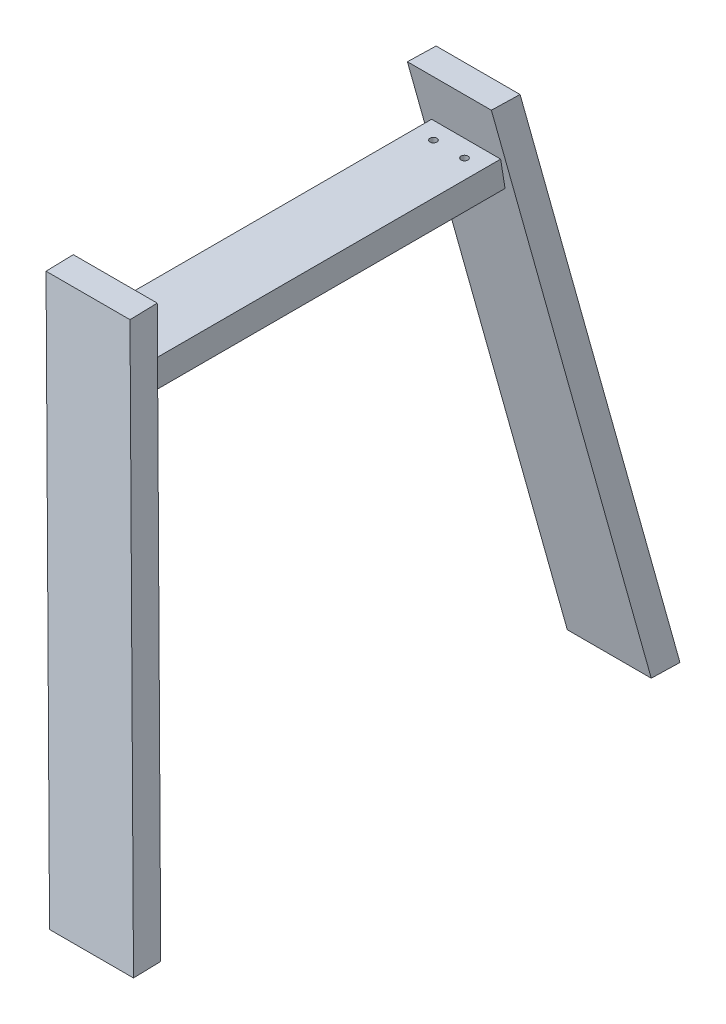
ISO-10303-21;
HEADER;
FILE_DESCRIPTION(('STEP AP214'),'2;1');
FILE_NAME('part.step','',(''),(''),'','','');
FILE_SCHEMA(('AUTOMOTIVE_DESIGN { 1 0 10303 214 1 1 1 1 }'));
ENDSEC;
DATA;
#1=APPLICATION_CONTEXT('core data for automotive mechanical design processes');
#2=APPLICATION_PROTOCOL_DEFINITION('international standard','automotive_design',2000,#1);
#3=PRODUCT_CONTEXT('',#1,'mechanical');
#4=PRODUCT('Part','Part','',(#3));
#5=PRODUCT_RELATED_PRODUCT_CATEGORY('part','',(#4));
#6=PRODUCT_DEFINITION_FORMATION('','',#4);
#7=PRODUCT_DEFINITION_CONTEXT('part definition',#1,'design');
#8=PRODUCT_DEFINITION('design','',#6,#7);
#9=PRODUCT_DEFINITION_SHAPE('','',#8);
#10=(LENGTH_UNIT() NAMED_UNIT(*) SI_UNIT(.MILLI.,.METRE.));
#11=(NAMED_UNIT(*) PLANE_ANGLE_UNIT() SI_UNIT($,.RADIAN.));
#12=(NAMED_UNIT(*) SI_UNIT($,.STERADIAN.) SOLID_ANGLE_UNIT());
#13=UNCERTAINTY_MEASURE_WITH_UNIT(LENGTH_MEASURE(1.E-05),#10,'distance_accuracy_value','');
#14=(GEOMETRIC_REPRESENTATION_CONTEXT(3) GLOBAL_UNCERTAINTY_ASSIGNED_CONTEXT((#13)) GLOBAL_UNIT_ASSIGNED_CONTEXT((#10,
#11,#12)) REPRESENTATION_CONTEXT('',''));
#15=CARTESIAN_POINT('',(0.,0.,0.));
#16=DIRECTION('',(0.,0.,1.));
#17=DIRECTION('',(1.,0.,0.));
#18=AXIS2_PLACEMENT_3D('',#15,#16,#17);
#19=CARTESIAN_POINT('',(-22.5,-70.,227.5));
#20=DIRECTION('',(0.,1.,0.));
#21=DIRECTION('',(0.,0.,1.));
#22=AXIS2_PLACEMENT_3D('',#19,#20,#21);
#23=CYLINDRICAL_SURFACE('',#22,5.);
#24=CARTESIAN_POINT('',(-22.5,0.,227.5));
#25=DIRECTION('',(0.,1.,0.));
#26=DIRECTION('',(0.,0.,1.));
#27=AXIS2_PLACEMENT_3D('',#24,#25,#26);
#28=CIRCLE('',#27,5.);
#29=CARTESIAN_POINT('',(-22.5,0.,232.5));
#30=VERTEX_POINT('',#29);
#31=EDGE_CURVE('E234',#30,#30,#28,.T.);
#32=ORIENTED_EDGE('',*,*,#31,.T.);
#33=EDGE_LOOP('',(#32));
#34=FACE_BOUND('',#33,.T.);
#35=CARTESIAN_POINT('',(-22.5,-30.,227.5));
#36=DIRECTION('',(0.,-1.,0.));
#37=DIRECTION('',(1.,0.,0.));
#38=AXIS2_PLACEMENT_3D('',#35,#36,#37);
#39=CIRCLE('',#38,5.);
#40=CARTESIAN_POINT('',(-17.5,-30.,227.5));
#41=VERTEX_POINT('',#40);
#42=EDGE_CURVE('E64',#41,#41,#39,.F.);
#43=ORIENTED_EDGE('',*,*,#42,.F.);
#44=EDGE_LOOP('',(#43));
#45=FACE_BOUND('',#44,.T.);
#46=ADVANCED_FACE('F60',(#34,#45),#23,.F.);
#47=CARTESIAN_POINT('',(22.5,-70.,227.5));
#48=DIRECTION('',(0.,1.,0.));
#49=DIRECTION('',(0.,0.,1.));
#50=AXIS2_PLACEMENT_3D('',#47,#48,#49);
#51=CYLINDRICAL_SURFACE('',#50,5.);
#52=CARTESIAN_POINT('',(22.5,0.,227.5));
#53=DIRECTION('',(0.,1.,0.));
#54=DIRECTION('',(0.,0.,1.));
#55=AXIS2_PLACEMENT_3D('',#52,#53,#54);
#56=CIRCLE('',#55,5.);
#57=CARTESIAN_POINT('',(22.5,0.,232.5));
#58=VERTEX_POINT('',#57);
#59=EDGE_CURVE('E231',#58,#58,#56,.T.);
#60=ORIENTED_EDGE('',*,*,#59,.T.);
#61=EDGE_LOOP('',(#60));
#62=FACE_BOUND('',#61,.T.);
#63=CARTESIAN_POINT('',(22.5,-30.,227.5));
#64=DIRECTION('',(0.,-1.,0.));
#65=DIRECTION('',(1.,0.,0.));
#66=AXIS2_PLACEMENT_3D('',#63,#64,#65);
#67=CIRCLE('',#66,5.);
#68=CARTESIAN_POINT('',(27.5,-30.,227.5));
#69=VERTEX_POINT('',#68);
#70=EDGE_CURVE('E227',#69,#69,#67,.F.);
#71=ORIENTED_EDGE('',*,*,#70,.F.);
#72=EDGE_LOOP('',(#71));
#73=FACE_BOUND('',#72,.T.);
#74=ADVANCED_FACE('F285',(#62,#73),#51,.F.);
#75=CARTESIAN_POINT('',(55.3614996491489,-715.162975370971,366.439785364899));
#76=DIRECTION('',(0.,-0.157531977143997,-0.987513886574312));
#77=DIRECTION('',(0.,0.987513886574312,-0.157531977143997));
#78=AXIS2_PLACEMENT_3D('',#75,#76,#77);
#79=PLANE('',#78);
#80=DIRECTION('',(1.,0.,0.));
#81=VECTOR('',#80,1.);
#82=CARTESIAN_POINT('',(55.3614996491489,-645.,355.247120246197));
#83=LINE('',#82,#81);
#84=CARTESIAN_POINT('',(43.6676704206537,-645.,355.247120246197));
#85=VERTEX_POINT('',#84);
#86=CARTESIAN_POINT('',(165.282116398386,-645.,355.247120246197));
#87=VERTEX_POINT('',#86);
#88=EDGE_CURVE('E239',#85,#87,#83,.T.);
#89=ORIENTED_EDGE('',*,*,#88,.F.);
#90=DIRECTION('',(-0.162400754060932,0.974404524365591,-0.155440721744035));
#91=VECTOR('',#90,1.);
#92=CARTESIAN_POINT('',(55.3614996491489,-715.162975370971,366.439785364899));
#93=LINE('',#92,#91);
#94=CARTESIAN_POINT('',(-74.6656629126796,65.0000000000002,241.985215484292));
#95=VERTEX_POINT('',#94);
#96=EDGE_CURVE('E257',#85,#95,#93,.T.);
#97=ORIENTED_EDGE('',*,*,#96,.T.);
#98=DIRECTION('',(1.,0.,0.));
#99=VECTOR('',#98,1.);
#100=CARTESIAN_POINT('',(55.3614996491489,65.0000000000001,241.985215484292));
#101=LINE('',#100,#99);
#102=CARTESIAN_POINT('',(46.9487830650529,65.0000000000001,241.985215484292));
#103=VERTEX_POINT('',#102);
#104=EDGE_CURVE('E248',#95,#103,#101,.T.);
#105=ORIENTED_EDGE('',*,*,#104,.T.);
#106=DIRECTION('',(-0.162400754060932,0.974404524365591,-0.155440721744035));
#107=VECTOR('',#106,1.);
#108=CARTESIAN_POINT('',(173.768485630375,-695.918215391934,363.369787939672));
#109=LINE('',#108,#107);
#110=EDGE_CURVE('E251',#87,#103,#109,.T.);
#111=ORIENTED_EDGE('',*,*,#110,.F.);
#112=EDGE_LOOP('',(#89,#97,#105,#111));
#113=FACE_BOUND('',#112,.T.);
#114=DIRECTION('',(0.,-0.987513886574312,0.157531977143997));
#115=VECTOR('',#114,1.);
#116=CARTESIAN_POINT('',(50.,-46.4193568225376,259.759255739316));
#117=LINE('',#116,#115);
#118=CARTESIAN_POINT('',(50.,0.,252.35426310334));
#119=VERTEX_POINT('',#118);
#120=CARTESIAN_POINT('',(50.,-40.,258.735215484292));
#121=VERTEX_POINT('',#120);
#122=EDGE_CURVE('E265',#119,#121,#117,.T.);
#123=ORIENTED_EDGE('',*,*,#122,.F.);
#124=DIRECTION('',(1.,0.,0.));
#125=VECTOR('',#124,1.);
#126=CARTESIAN_POINT('',(-50.,0.,252.35426310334));
#127=LINE('',#126,#125);
#128=CARTESIAN_POINT('',(-50.,0.,252.35426310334));
#129=VERTEX_POINT('',#128);
#130=EDGE_CURVE('E262',#129,#119,#127,.T.);
#131=ORIENTED_EDGE('',*,*,#130,.F.);
#132=DIRECTION('',(0.,0.987513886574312,-0.157531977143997));
#133=VECTOR('',#132,1.);
#134=CARTESIAN_POINT('',(-50.,-46.4193568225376,259.759255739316));
#135=LINE('',#134,#133);
#136=CARTESIAN_POINT('',(-50.,-40.,258.735215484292));
#137=VERTEX_POINT('',#136);
#138=EDGE_CURVE('E254',#137,#129,#135,.T.);
#139=ORIENTED_EDGE('',*,*,#138,.F.);
#140=DIRECTION('',(-1.,0.,0.));
#141=VECTOR('',#140,1.);
#142=CARTESIAN_POINT('',(-50.,-40.,258.735215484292));
#143=LINE('',#142,#141);
#144=EDGE_CURVE('E276',#121,#137,#143,.T.);
#145=ORIENTED_EDGE('',*,*,#144,.F.);
#146=EDGE_LOOP('',(#123,#131,#139,#145));
#147=FACE_BOUND('',#146,.T.);
#148=ADVANCED_FACE('F287',(#113,#147),#79,.T.);
#149=CARTESIAN_POINT('',(173.768485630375,-695.918215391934,363.369787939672));
#150=DIRECTION('',(0.986724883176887,0.16037299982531,-0.0255833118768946));
#151=DIRECTION('',(-0.160425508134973,0.987047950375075,0.));
#152=AXIS2_PLACEMENT_3D('',#149,#150,#151);
#153=PLANE('',#152);
#154=DIRECTION('',(0.0259187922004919,0.,0.999664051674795));
#155=VECTOR('',#154,1.);
#156=CARTESIAN_POINT('',(165.498276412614,-645.,363.584213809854));
#157=LINE('',#156,#155);
#158=CARTESIAN_POINT('',(166.332329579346,-645.,395.752879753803));
#159=VERTEX_POINT('',#158);
#160=EDGE_CURVE('E77',#87,#159,#157,.T.);
#161=ORIENTED_EDGE('',*,*,#160,.F.);
#162=ORIENTED_EDGE('',*,*,#110,.T.);
#163=DIRECTION('',(0.0259187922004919,0.,0.999664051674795));
#164=VECTOR('',#163,1.);
#165=CARTESIAN_POINT('',(50.1790630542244,64.9999999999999,366.574153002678));
#166=LINE('',#165,#164);
#167=CARTESIAN_POINT('',(47.9989962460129,65.0000000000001,282.490974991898));
#168=VERTEX_POINT('',#167);
#169=EDGE_CURVE('E245',#103,#168,#166,.T.);
#170=ORIENTED_EDGE('',*,*,#169,.T.);
#171=DIRECTION('',(-0.162400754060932,0.974404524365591,-0.155440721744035));
#172=VECTOR('',#171,1.);
#173=CARTESIAN_POINT('',(173.768485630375,-689.616936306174,402.870343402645));
#174=LINE('',#173,#172);
#175=EDGE_CURVE('E252',#159,#168,#174,.T.);
#176=ORIENTED_EDGE('',*,*,#175,.F.);
#177=EDGE_LOOP('',(#161,#162,#170,#176));
#178=FACE_BOUND('',#177,.T.);
#179=ADVANCED_FACE('F294',(#178),#153,.T.);
#180=CARTESIAN_POINT('',(55.3614996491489,-708.861696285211,405.940340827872));
#181=DIRECTION('',(0.,0.157531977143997,0.987513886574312));
#182=DIRECTION('',(0.,-0.987513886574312,0.157531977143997));
#183=AXIS2_PLACEMENT_3D('',#180,#181,#182);
#184=PLANE('',#183);
#185=DIRECTION('',(-1.,0.,0.));
#186=VECTOR('',#185,1.);
#187=CARTESIAN_POINT('',(55.3614996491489,-645.,395.752879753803));
#188=LINE('',#187,#186);
#189=CARTESIAN_POINT('',(44.7178836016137,-645.,395.752879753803));
#190=VERTEX_POINT('',#189);
#191=EDGE_CURVE('E85',#159,#190,#188,.T.);
#192=ORIENTED_EDGE('',*,*,#191,.F.);
#193=ORIENTED_EDGE('',*,*,#175,.T.);
#194=DIRECTION('',(-1.,0.,0.));
#195=VECTOR('',#194,1.);
#196=CARTESIAN_POINT('',(55.3614996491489,64.9999999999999,282.490974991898));
#197=LINE('',#196,#195);
#198=CARTESIAN_POINT('',(-73.6154497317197,65.0000000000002,282.490974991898));
#199=VERTEX_POINT('',#198);
#200=EDGE_CURVE('E242',#168,#199,#197,.T.);
#201=ORIENTED_EDGE('',*,*,#200,.T.);
#202=DIRECTION('',(-0.162400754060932,0.974404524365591,-0.155440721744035));
#203=VECTOR('',#202,1.);
#204=CARTESIAN_POINT('',(55.3614996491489,-708.861696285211,405.940340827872));
#205=LINE('',#204,#203);
#206=EDGE_CURVE('E255',#190,#199,#205,.T.);
#207=ORIENTED_EDGE('',*,*,#206,.F.);
#208=EDGE_LOOP('',(#192,#193,#201,#207));
#209=FACE_BOUND('',#208,.T.);
#210=ADVANCED_FACE('F312',(#209),#184,.T.);
#211=CARTESIAN_POINT('',(55.3614996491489,-715.162975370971,366.439785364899));
#212=DIRECTION('',(-0.986724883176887,-0.16037299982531,0.0255833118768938));
#213=DIRECTION('',(0.160425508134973,-0.987047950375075,0.));
#214=AXIS2_PLACEMENT_3D('',#211,#212,#213);
#215=PLANE('',#214);
#216=DIRECTION('',(-0.0259187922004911,0.,-0.999664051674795));
#217=VECTOR('',#216,1.);
#218=CARTESIAN_POINT('',(43.9655290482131,-645.,366.735254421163));
#219=LINE('',#218,#217);
#220=EDGE_CURVE('E12',#190,#85,#219,.T.);
#221=ORIENTED_EDGE('',*,*,#220,.F.);
#222=ORIENTED_EDGE('',*,*,#206,.T.);
#223=DIRECTION('',(-0.0259187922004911,0.,-0.999664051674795));
#224=VECTOR('',#223,1.);
#225=CARTESIAN_POINT('',(-71.3536843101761,65.0000000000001,369.725193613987));
#226=LINE('',#225,#224);
#227=EDGE_CURVE('E69',#199,#95,#226,.T.);
#228=ORIENTED_EDGE('',*,*,#227,.T.);
#229=ORIENTED_EDGE('',*,*,#96,.F.);
#230=EDGE_LOOP('',(#221,#222,#228,#229));
#231=FACE_BOUND('',#230,.T.);
#232=ADVANCED_FACE('F315',(#231),#215,.T.);
#233=CARTESIAN_POINT('',(50.,-40.,300.));
#234=DIRECTION('',(-1.,0.,0.));
#235=DIRECTION('',(0.,0.,1.));
#236=AXIS2_PLACEMENT_3D('',#233,#234,#235);
#237=PLANE('',#236);
#238=DIRECTION('',(0.,0.,-1.));
#239=VECTOR('',#238,1.);
#240=CARTESIAN_POINT('',(50.,0.,300.));
#241=LINE('',#240,#239);
#242=CARTESIAN_POINT('',(50.,0.,-252.35426310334));
#243=VERTEX_POINT('',#242);
#244=EDGE_CURVE('E274',#119,#243,#241,.T.);
#245=ORIENTED_EDGE('',*,*,#244,.F.);
#246=ORIENTED_EDGE('',*,*,#122,.T.);
#247=DIRECTION('',(0.,0.,-1.));
#248=VECTOR('',#247,1.);
#249=CARTESIAN_POINT('',(50.,-40.,300.));
#250=LINE('',#249,#248);
#251=CARTESIAN_POINT('',(50.,-40.,-258.735215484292));
#252=VERTEX_POINT('',#251);
#253=EDGE_CURVE('E268',#121,#252,#250,.T.);
#254=ORIENTED_EDGE('',*,*,#253,.T.);
#255=DIRECTION('',(0.,-0.987513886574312,-0.157531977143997));
#256=VECTOR('',#255,1.);
#257=CARTESIAN_POINT('',(50.,-46.4193568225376,-259.759255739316));
#258=LINE('',#257,#256);
#259=EDGE_CURVE('E202',#243,#252,#258,.T.);
#260=ORIENTED_EDGE('',*,*,#259,.F.);
#261=EDGE_LOOP('',(#245,#246,#254,#260));
#262=FACE_BOUND('',#261,.T.);
#263=ADVANCED_FACE('F62',(#262),#237,.F.);
#264=CARTESIAN_POINT('',(-50.,0.,300.));
#265=DIRECTION('',(0.,-1.,0.));
#266=DIRECTION('',(1.,0.,0.));
#267=AXIS2_PLACEMENT_3D('',#264,#265,#266);
#268=PLANE('',#267);
#269=ORIENTED_EDGE('',*,*,#59,.F.);
#270=EDGE_LOOP('',(#269));
#271=FACE_BOUND('',#270,.T.);
#272=ORIENTED_EDGE('',*,*,#31,.F.);
#273=EDGE_LOOP('',(#272));
#274=FACE_BOUND('',#273,.T.);
#275=DIRECTION('',(0.,0.,-1.));
#276=VECTOR('',#275,1.);
#277=CARTESIAN_POINT('',(-50.,0.,300.));
#278=LINE('',#277,#276);
#279=CARTESIAN_POINT('',(-50.,0.,-252.35426310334));
#280=VERTEX_POINT('',#279);
#281=EDGE_CURVE('E272',#129,#280,#278,.T.);
#282=ORIENTED_EDGE('',*,*,#281,.F.);
#283=ORIENTED_EDGE('',*,*,#130,.T.);
#284=ORIENTED_EDGE('',*,*,#244,.T.);
#285=DIRECTION('',(1.,0.,0.));
#286=VECTOR('',#285,1.);
#287=CARTESIAN_POINT('',(-50.,0.,-252.35426310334));
#288=LINE('',#287,#286);
#289=EDGE_CURVE('E199',#280,#243,#288,.T.);
#290=ORIENTED_EDGE('',*,*,#289,.F.);
#291=EDGE_LOOP('',(#282,#283,#284,#290));
#292=FACE_BOUND('',#291,.T.);
#293=CARTESIAN_POINT('',(22.5,0.,-227.5));
#294=DIRECTION('',(0.,-1.,0.));
#295=DIRECTION('',(0.,0.,-1.));
#296=AXIS2_PLACEMENT_3D('',#293,#294,#295);
#297=CIRCLE('',#296,5.);
#298=CARTESIAN_POINT('',(22.5,0.,-232.5));
#299=VERTEX_POINT('',#298);
#300=EDGE_CURVE('E212',#299,#299,#297,.T.);
#301=ORIENTED_EDGE('',*,*,#300,.T.);
#302=EDGE_LOOP('',(#301));
#303=FACE_BOUND('',#302,.T.);
#304=CARTESIAN_POINT('',(-22.5,0.,-227.5));
#305=DIRECTION('',(0.,-1.,0.));
#306=DIRECTION('',(0.,0.,-1.));
#307=AXIS2_PLACEMENT_3D('',#304,#305,#306);
#308=CIRCLE('',#307,5.);
#309=CARTESIAN_POINT('',(-22.5,0.,-232.5));
#310=VERTEX_POINT('',#309);
#311=EDGE_CURVE('E346',#310,#310,#308,.T.);
#312=ORIENTED_EDGE('',*,*,#311,.T.);
#313=EDGE_LOOP('',(#312));
#314=FACE_BOUND('',#313,.T.);
#315=ADVANCED_FACE('F326',(#271,#274,#292,#303,#314),#268,.F.);
#316=CARTESIAN_POINT('',(-50.,-40.,300.));
#317=DIRECTION('',(1.,0.,0.));
#318=DIRECTION('',(0.,0.,-1.));
#319=AXIS2_PLACEMENT_3D('',#316,#317,#318);
#320=PLANE('',#319);
#321=DIRECTION('',(0.,0.,-1.));
#322=VECTOR('',#321,1.);
#323=CARTESIAN_POINT('',(-50.,-40.,300.));
#324=LINE('',#323,#322);
#325=CARTESIAN_POINT('',(-50.,-40.,-258.735215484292));
#326=VERTEX_POINT('',#325);
#327=EDGE_CURVE('E270',#137,#326,#324,.T.);
#328=ORIENTED_EDGE('',*,*,#327,.F.);
#329=ORIENTED_EDGE('',*,*,#138,.T.);
#330=ORIENTED_EDGE('',*,*,#281,.T.);
#331=DIRECTION('',(0.,0.987513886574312,0.157531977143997));
#332=VECTOR('',#331,1.);
#333=CARTESIAN_POINT('',(-50.,-46.4193568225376,-259.759255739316));
#334=LINE('',#333,#332);
#335=EDGE_CURVE('E194',#326,#280,#334,.T.);
#336=ORIENTED_EDGE('',*,*,#335,.F.);
#337=EDGE_LOOP('',(#328,#329,#330,#336));
#338=FACE_BOUND('',#337,.T.);
#339=ADVANCED_FACE('F323',(#338),#320,.F.);
#340=CARTESIAN_POINT('',(-50.,-40.,300.));
#341=DIRECTION('',(0.,1.,0.));
#342=DIRECTION('',(-1.,0.,0.));
#343=AXIS2_PLACEMENT_3D('',#340,#341,#342);
#344=PLANE('',#343);
#345=CARTESIAN_POINT('',(-22.5,-40.,227.5));
#346=DIRECTION('',(0.,-1.,0.));
#347=DIRECTION('',(1.,0.,0.));
#348=AXIS2_PLACEMENT_3D('',#345,#346,#347);
#349=CIRCLE('',#348,9.);
#350=CARTESIAN_POINT('',(-13.5,-40.,227.5));
#351=VERTEX_POINT('',#350);
#352=EDGE_CURVE('E162',#351,#351,#349,.T.);
#353=ORIENTED_EDGE('',*,*,#352,.F.);
#354=EDGE_LOOP('',(#353));
#355=FACE_BOUND('',#354,.T.);
#356=CARTESIAN_POINT('',(22.5,-40.,227.5));
#357=DIRECTION('',(0.,-1.,0.));
#358=DIRECTION('',(1.,0.,0.));
#359=AXIS2_PLACEMENT_3D('',#356,#357,#358);
#360=CIRCLE('',#359,9.);
#361=CARTESIAN_POINT('',(31.5,-40.,227.5));
#362=VERTEX_POINT('',#361);
#363=EDGE_CURVE('E228',#362,#362,#360,.T.);
#364=ORIENTED_EDGE('',*,*,#363,.F.);
#365=EDGE_LOOP('',(#364));
#366=FACE_BOUND('',#365,.T.);
#367=ORIENTED_EDGE('',*,*,#253,.F.);
#368=ORIENTED_EDGE('',*,*,#144,.T.);
#369=ORIENTED_EDGE('',*,*,#327,.T.);
#370=DIRECTION('',(-1.,0.,0.));
#371=VECTOR('',#370,1.);
#372=CARTESIAN_POINT('',(-50.,-40.,-258.735215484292));
#373=LINE('',#372,#371);
#374=EDGE_CURVE('E205',#252,#326,#373,.T.);
#375=ORIENTED_EDGE('',*,*,#374,.F.);
#376=EDGE_LOOP('',(#367,#368,#369,#375));
#377=FACE_BOUND('',#376,.T.);
#378=CARTESIAN_POINT('',(-22.5,-40.,-227.5));
#379=DIRECTION('',(0.,1.,0.));
#380=DIRECTION('',(1.,0.,0.));
#381=AXIS2_PLACEMENT_3D('',#378,#379,#380);
#382=CIRCLE('',#381,9.);
#383=CARTESIAN_POINT('',(-13.5,-40.,-227.5));
#384=VERTEX_POINT('',#383);
#385=EDGE_CURVE('E355',#384,#384,#382,.T.);
#386=ORIENTED_EDGE('',*,*,#385,.T.);
#387=EDGE_LOOP('',(#386));
#388=FACE_BOUND('',#387,.T.);
#389=CARTESIAN_POINT('',(22.5,-40.,-227.5));
#390=DIRECTION('',(0.,1.,0.));
#391=DIRECTION('',(1.,0.,0.));
#392=AXIS2_PLACEMENT_3D('',#389,#390,#391);
#393=CIRCLE('',#392,9.);
#394=CARTESIAN_POINT('',(31.5,-40.,-227.5));
#395=VERTEX_POINT('',#394);
#396=EDGE_CURVE('E217',#395,#395,#393,.T.);
#397=ORIENTED_EDGE('',*,*,#396,.T.);
#398=EDGE_LOOP('',(#397));
#399=FACE_BOUND('',#398,.T.);
#400=ADVANCED_FACE('F310',(#355,#366,#377,#388,#399),#344,.F.);
#401=CARTESIAN_POINT('',(-112.804446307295,65.,1563.49537928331));
#402=DIRECTION('',(0.,1.,0.));
#403=DIRECTION('',(0.,0.,1.));
#404=AXIS2_PLACEMENT_3D('',#401,#402,#403);
#405=PLANE('',#404);
#406=ORIENTED_EDGE('',*,*,#104,.F.);
#407=ORIENTED_EDGE('',*,*,#227,.F.);
#408=ORIENTED_EDGE('',*,*,#200,.F.);
#409=ORIENTED_EDGE('',*,*,#169,.F.);
#410=EDGE_LOOP('',(#406,#407,#408,#409));
#411=FACE_BOUND('',#410,.T.);
#412=ADVANCED_FACE('F306',(#411),#405,.T.);
#413=CARTESIAN_POINT('',(-408.776341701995,-645.,1444.82105582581));
#414=DIRECTION('',(0.,1.,0.));
#415=DIRECTION('',(0.,0.,1.));
#416=AXIS2_PLACEMENT_3D('',#413,#414,#415);
#417=PLANE('',#416);
#418=ORIENTED_EDGE('',*,*,#220,.T.);
#419=ORIENTED_EDGE('',*,*,#88,.T.);
#420=ORIENTED_EDGE('',*,*,#160,.T.);
#421=ORIENTED_EDGE('',*,*,#191,.T.);
#422=EDGE_LOOP('',(#418,#419,#420,#421));
#423=FACE_BOUND('',#422,.T.);
#424=ADVANCED_FACE('F303',(#423),#417,.F.);
#425=CARTESIAN_POINT('',(22.5,-30.,227.5));
#426=DIRECTION('',(0.,-1.,0.));
#427=DIRECTION('',(1.,0.,0.));
#428=AXIS2_PLACEMENT_3D('',#425,#426,#427);
#429=PLANE('',#428);
#430=CARTESIAN_POINT('',(22.5,-30.,227.5));
#431=DIRECTION('',(0.,-1.,0.));
#432=DIRECTION('',(1.,0.,0.));
#433=AXIS2_PLACEMENT_3D('',#430,#431,#432);
#434=CIRCLE('',#433,9.);
#435=CARTESIAN_POINT('',(31.5,-30.,227.5));
#436=VERTEX_POINT('',#435);
#437=EDGE_CURVE('E224',#436,#436,#434,.T.);
#438=ORIENTED_EDGE('',*,*,#437,.T.);
#439=EDGE_LOOP('',(#438));
#440=FACE_BOUND('',#439,.T.);
#441=ORIENTED_EDGE('',*,*,#70,.T.);
#442=EDGE_LOOP('',(#441));
#443=FACE_BOUND('',#442,.T.);
#444=ADVANCED_FACE('F283',(#440,#443),#429,.T.);
#445=CARTESIAN_POINT('',(22.5,-30.,227.5));
#446=DIRECTION('',(0.,-1.,0.));
#447=DIRECTION('',(1.,0.,0.));
#448=AXIS2_PLACEMENT_3D('',#445,#446,#447);
#449=CYLINDRICAL_SURFACE('',#448,9.);
#450=ORIENTED_EDGE('',*,*,#437,.F.);
#451=EDGE_LOOP('',(#450));
#452=FACE_BOUND('',#451,.T.);
#453=ORIENTED_EDGE('',*,*,#363,.T.);
#454=EDGE_LOOP('',(#453));
#455=FACE_BOUND('',#454,.T.);
#456=ADVANCED_FACE('F300',(#452,#455),#449,.F.);
#457=CARTESIAN_POINT('',(-22.5,-30.,227.5));
#458=DIRECTION('',(0.,-1.,0.));
#459=DIRECTION('',(1.,0.,0.));
#460=AXIS2_PLACEMENT_3D('',#457,#458,#459);
#461=PLANE('',#460);
#462=CARTESIAN_POINT('',(-22.5,-30.,227.5));
#463=DIRECTION('',(0.,-1.,0.));
#464=DIRECTION('',(1.,0.,0.));
#465=AXIS2_PLACEMENT_3D('',#462,#463,#464);
#466=CIRCLE('',#465,9.);
#467=CARTESIAN_POINT('',(-13.5,-30.,227.5));
#468=VERTEX_POINT('',#467);
#469=EDGE_CURVE('E219',#468,#468,#466,.T.);
#470=ORIENTED_EDGE('',*,*,#469,.T.);
#471=EDGE_LOOP('',(#470));
#472=FACE_BOUND('',#471,.T.);
#473=ORIENTED_EDGE('',*,*,#42,.T.);
#474=EDGE_LOOP('',(#473));
#475=FACE_BOUND('',#474,.T.);
#476=ADVANCED_FACE('F382',(#472,#475),#461,.T.);
#477=CARTESIAN_POINT('',(-22.5,-30.,227.5));
#478=DIRECTION('',(0.,-1.,0.));
#479=DIRECTION('',(1.,0.,0.));
#480=AXIS2_PLACEMENT_3D('',#477,#478,#479);
#481=CYLINDRICAL_SURFACE('',#480,9.);
#482=ORIENTED_EDGE('',*,*,#469,.F.);
#483=EDGE_LOOP('',(#482));
#484=FACE_BOUND('',#483,.T.);
#485=ORIENTED_EDGE('',*,*,#352,.T.);
#486=EDGE_LOOP('',(#485));
#487=FACE_BOUND('',#486,.T.);
#488=ADVANCED_FACE('F374',(#484,#487),#481,.F.);
#489=CARTESIAN_POINT('',(-22.5,-70.,-227.5));
#490=DIRECTION('',(0.,1.,0.));
#491=DIRECTION('',(0.,0.,-1.));
#492=AXIS2_PLACEMENT_3D('',#489,#490,#491);
#493=CYLINDRICAL_SURFACE('',#492,5.);
#494=ORIENTED_EDGE('',*,*,#311,.F.);
#495=EDGE_LOOP('',(#494));
#496=FACE_BOUND('',#495,.T.);
#497=CARTESIAN_POINT('',(-22.5,-30.,-227.5));
#498=DIRECTION('',(0.,1.,0.));
#499=DIRECTION('',(1.,0.,0.));
#500=AXIS2_PLACEMENT_3D('',#497,#498,#499);
#501=CIRCLE('',#500,5.);
#502=CARTESIAN_POINT('',(-17.5,-30.,-227.5));
#503=VERTEX_POINT('',#502);
#504=EDGE_CURVE('E214',#503,#503,#501,.F.);
#505=ORIENTED_EDGE('',*,*,#504,.T.);
#506=EDGE_LOOP('',(#505));
#507=FACE_BOUND('',#506,.T.);
#508=ADVANCED_FACE('F371',(#496,#507),#493,.F.);
#509=CARTESIAN_POINT('',(22.5,-70.,-227.5));
#510=DIRECTION('',(0.,1.,0.));
#511=DIRECTION('',(0.,0.,-1.));
#512=AXIS2_PLACEMENT_3D('',#509,#510,#511);
#513=CYLINDRICAL_SURFACE('',#512,5.);
#514=ORIENTED_EDGE('',*,*,#300,.F.);
#515=EDGE_LOOP('',(#514));
#516=FACE_BOUND('',#515,.T.);
#517=CARTESIAN_POINT('',(22.5,-30.,-227.5));
#518=DIRECTION('',(0.,1.,0.));
#519=DIRECTION('',(1.,0.,0.));
#520=AXIS2_PLACEMENT_3D('',#517,#518,#519);
#521=CIRCLE('',#520,5.);
#522=CARTESIAN_POINT('',(27.5,-30.,-227.5));
#523=VERTEX_POINT('',#522);
#524=EDGE_CURVE('E209',#523,#523,#521,.F.);
#525=ORIENTED_EDGE('',*,*,#524,.T.);
#526=EDGE_LOOP('',(#525));
#527=FACE_BOUND('',#526,.T.);
#528=ADVANCED_FACE('F373',(#516,#527),#513,.F.);
#529=CARTESIAN_POINT('',(55.3614996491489,-715.162975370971,-366.439785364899));
#530=DIRECTION('',(0.,-0.157531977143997,0.987513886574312));
#531=DIRECTION('',(0.,0.987513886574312,0.157531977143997));
#532=AXIS2_PLACEMENT_3D('',#529,#530,#531);
#533=PLANE('',#532);
#534=DIRECTION('',(1.,0.,0.));
#535=VECTOR('',#534,1.);
#536=CARTESIAN_POINT('',(55.3614996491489,-645.,-355.247120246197));
#537=LINE('',#536,#535);
#538=CARTESIAN_POINT('',(43.6676704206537,-645.,-355.247120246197));
#539=VERTEX_POINT('',#538);
#540=CARTESIAN_POINT('',(165.282116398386,-645.,-355.247120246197));
#541=VERTEX_POINT('',#540);
#542=EDGE_CURVE('E170',#539,#541,#537,.T.);
#543=ORIENTED_EDGE('',*,*,#542,.T.);
#544=DIRECTION('',(-0.162400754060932,0.974404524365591,0.155440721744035));
#545=VECTOR('',#544,1.);
#546=CARTESIAN_POINT('',(173.768485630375,-695.918215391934,-363.369787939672));
#547=LINE('',#546,#545);
#548=CARTESIAN_POINT('',(46.9487830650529,65.0000000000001,-241.985215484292));
#549=VERTEX_POINT('',#548);
#550=EDGE_CURVE('E173',#541,#549,#547,.T.);
#551=ORIENTED_EDGE('',*,*,#550,.T.);
#552=DIRECTION('',(1.,0.,0.));
#553=VECTOR('',#552,1.);
#554=CARTESIAN_POINT('',(55.3614996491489,65.0000000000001,-241.985215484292));
#555=LINE('',#554,#553);
#556=CARTESIAN_POINT('',(-74.6656629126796,65.0000000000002,-241.985215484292));
#557=VERTEX_POINT('',#556);
#558=EDGE_CURVE('E172',#557,#549,#555,.T.);
#559=ORIENTED_EDGE('',*,*,#558,.F.);
#560=DIRECTION('',(-0.162400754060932,0.974404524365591,0.155440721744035));
#561=VECTOR('',#560,1.);
#562=CARTESIAN_POINT('',(55.3614996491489,-715.162975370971,-366.439785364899));
#563=LINE('',#562,#561);
#564=EDGE_CURVE('E155',#539,#557,#563,.T.);
#565=ORIENTED_EDGE('',*,*,#564,.F.);
#566=EDGE_LOOP('',(#543,#551,#559,#565));
#567=FACE_BOUND('',#566,.T.);
#568=ORIENTED_EDGE('',*,*,#259,.T.);
#569=ORIENTED_EDGE('',*,*,#374,.T.);
#570=ORIENTED_EDGE('',*,*,#335,.T.);
#571=ORIENTED_EDGE('',*,*,#289,.T.);
#572=EDGE_LOOP('',(#568,#569,#570,#571));
#573=FACE_BOUND('',#572,.T.);
#574=ADVANCED_FACE('F167',(#567,#573),#533,.T.);
#575=CARTESIAN_POINT('',(173.768485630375,-695.918215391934,-363.369787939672));
#576=DIRECTION('',(0.986724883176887,0.16037299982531,0.0255833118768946));
#577=DIRECTION('',(-0.160425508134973,0.987047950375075,0.));
#578=AXIS2_PLACEMENT_3D('',#575,#576,#577);
#579=PLANE('',#578);
#580=DIRECTION('',(0.0259187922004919,0.,-0.999664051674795));
#581=VECTOR('',#580,1.);
#582=CARTESIAN_POINT('',(165.498276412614,-645.,-363.584213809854));
#583=LINE('',#582,#581);
#584=CARTESIAN_POINT('',(166.332329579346,-645.,-395.752879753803));
#585=VERTEX_POINT('',#584);
#586=EDGE_CURVE('E177',#541,#585,#583,.T.);
#587=ORIENTED_EDGE('',*,*,#586,.T.);
#588=DIRECTION('',(-0.162400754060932,0.974404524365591,0.155440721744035));
#589=VECTOR('',#588,1.);
#590=CARTESIAN_POINT('',(173.768485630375,-689.616936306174,-402.870343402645));
#591=LINE('',#590,#589);
#592=CARTESIAN_POINT('',(47.9989962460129,65.0000000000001,-282.490974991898));
#593=VERTEX_POINT('',#592);
#594=EDGE_CURVE('E191',#585,#593,#591,.T.);
#595=ORIENTED_EDGE('',*,*,#594,.T.);
#596=DIRECTION('',(0.0259187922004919,0.,-0.999664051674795));
#597=VECTOR('',#596,1.);
#598=CARTESIAN_POINT('',(50.1790630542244,64.9999999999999,-366.574153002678));
#599=LINE('',#598,#597);
#600=EDGE_CURVE('E182',#549,#593,#599,.T.);
#601=ORIENTED_EDGE('',*,*,#600,.F.);
#602=ORIENTED_EDGE('',*,*,#550,.F.);
#603=EDGE_LOOP('',(#587,#595,#601,#602));
#604=FACE_BOUND('',#603,.T.);
#605=ADVANCED_FACE('F397',(#604),#579,.T.);
#606=CARTESIAN_POINT('',(55.3614996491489,-708.861696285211,-405.940340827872));
#607=DIRECTION('',(0.,0.157531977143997,-0.987513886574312));
#608=DIRECTION('',(0.,-0.987513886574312,-0.157531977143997));
#609=AXIS2_PLACEMENT_3D('',#606,#607,#608);
#610=PLANE('',#609);
#611=DIRECTION('',(-1.,0.,0.));
#612=VECTOR('',#611,1.);
#613=CARTESIAN_POINT('',(55.3614996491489,-645.,-395.752879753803));
#614=LINE('',#613,#612);
#615=CARTESIAN_POINT('',(44.7178836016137,-645.,-395.752879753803));
#616=VERTEX_POINT('',#615);
#617=EDGE_CURVE('E184',#585,#616,#614,.T.);
#618=ORIENTED_EDGE('',*,*,#617,.T.);
#619=DIRECTION('',(-0.162400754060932,0.974404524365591,0.155440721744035));
#620=VECTOR('',#619,1.);
#621=CARTESIAN_POINT('',(55.3614996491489,-708.861696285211,-405.940340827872));
#622=LINE('',#621,#620);
#623=CARTESIAN_POINT('',(-73.6154497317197,65.0000000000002,-282.490974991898));
#624=VERTEX_POINT('',#623);
#625=EDGE_CURVE('E158',#616,#624,#622,.T.);
#626=ORIENTED_EDGE('',*,*,#625,.T.);
#627=DIRECTION('',(-1.,0.,0.));
#628=VECTOR('',#627,1.);
#629=CARTESIAN_POINT('',(55.3614996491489,64.9999999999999,-282.490974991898));
#630=LINE('',#629,#628);
#631=EDGE_CURVE('E179',#593,#624,#630,.T.);
#632=ORIENTED_EDGE('',*,*,#631,.F.);
#633=ORIENTED_EDGE('',*,*,#594,.F.);
#634=EDGE_LOOP('',(#618,#626,#632,#633));
#635=FACE_BOUND('',#634,.T.);
#636=ADVANCED_FACE('F394',(#635),#610,.T.);
#637=CARTESIAN_POINT('',(55.3614996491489,-715.162975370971,-366.439785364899));
#638=DIRECTION('',(-0.986724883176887,-0.16037299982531,-0.0255833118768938));
#639=DIRECTION('',(0.160425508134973,-0.987047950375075,0.));
#640=AXIS2_PLACEMENT_3D('',#637,#638,#639);
#641=PLANE('',#640);
#642=DIRECTION('',(-0.0259187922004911,0.,0.999664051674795));
#643=VECTOR('',#642,1.);
#644=CARTESIAN_POINT('',(43.9655290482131,-645.,-366.735254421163));
#645=LINE('',#644,#643);
#646=EDGE_CURVE('E152',#616,#539,#645,.T.);
#647=ORIENTED_EDGE('',*,*,#646,.T.);
#648=ORIENTED_EDGE('',*,*,#564,.T.);
#649=DIRECTION('',(-0.0259187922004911,0.,0.999664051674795));
#650=VECTOR('',#649,1.);
#651=CARTESIAN_POINT('',(-71.3536843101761,65.0000000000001,-369.725193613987));
#652=LINE('',#651,#650);
#653=EDGE_CURVE('E163',#624,#557,#652,.T.);
#654=ORIENTED_EDGE('',*,*,#653,.F.);
#655=ORIENTED_EDGE('',*,*,#625,.F.);
#656=EDGE_LOOP('',(#647,#648,#654,#655));
#657=FACE_BOUND('',#656,.T.);
#658=ADVANCED_FACE('F154',(#657),#641,.T.);
#659=CARTESIAN_POINT('',(-112.804446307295,65.,-1563.49537928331));
#660=DIRECTION('',(0.,1.,0.));
#661=DIRECTION('',(0.,0.,-1.));
#662=AXIS2_PLACEMENT_3D('',#659,#660,#661);
#663=PLANE('',#662);
#664=ORIENTED_EDGE('',*,*,#558,.T.);
#665=ORIENTED_EDGE('',*,*,#600,.T.);
#666=ORIENTED_EDGE('',*,*,#631,.T.);
#667=ORIENTED_EDGE('',*,*,#653,.T.);
#668=EDGE_LOOP('',(#664,#665,#666,#667));
#669=FACE_BOUND('',#668,.T.);
#670=ADVANCED_FACE('F390',(#669),#663,.T.);
#671=CARTESIAN_POINT('',(-408.776341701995,-645.,-1444.82105582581));
#672=DIRECTION('',(0.,1.,0.));
#673=DIRECTION('',(0.,0.,-1.));
#674=AXIS2_PLACEMENT_3D('',#671,#672,#673);
#675=PLANE('',#674);
#676=ORIENTED_EDGE('',*,*,#646,.F.);
#677=ORIENTED_EDGE('',*,*,#617,.F.);
#678=ORIENTED_EDGE('',*,*,#586,.F.);
#679=ORIENTED_EDGE('',*,*,#542,.F.);
#680=EDGE_LOOP('',(#676,#677,#678,#679));
#681=FACE_BOUND('',#680,.T.);
#682=ADVANCED_FACE('F175',(#681),#675,.F.);
#683=CARTESIAN_POINT('',(22.5,-30.,-227.5));
#684=DIRECTION('',(0.,-1.,0.));
#685=DIRECTION('',(1.,0.,0.));
#686=AXIS2_PLACEMENT_3D('',#683,#684,#685);
#687=PLANE('',#686);
#688=CARTESIAN_POINT('',(22.5,-30.,-227.5));
#689=DIRECTION('',(0.,1.,0.));
#690=DIRECTION('',(1.,0.,0.));
#691=AXIS2_PLACEMENT_3D('',#688,#689,#690);
#692=CIRCLE('',#691,9.);
#693=CARTESIAN_POINT('',(31.5,-30.,-227.5));
#694=VERTEX_POINT('',#693);
#695=EDGE_CURVE('E213',#694,#694,#692,.T.);
#696=ORIENTED_EDGE('',*,*,#695,.F.);
#697=EDGE_LOOP('',(#696));
#698=FACE_BOUND('',#697,.T.);
#699=ORIENTED_EDGE('',*,*,#524,.F.);
#700=EDGE_LOOP('',(#699));
#701=FACE_BOUND('',#700,.T.);
#702=ADVANCED_FACE('F389',(#698,#701),#687,.T.);
#703=CARTESIAN_POINT('',(22.5,-30.,-227.5));
#704=DIRECTION('',(0.,-1.,0.));
#705=DIRECTION('',(1.,0.,0.));
#706=AXIS2_PLACEMENT_3D('',#703,#704,#705);
#707=CYLINDRICAL_SURFACE('',#706,9.);
#708=ORIENTED_EDGE('',*,*,#695,.T.);
#709=EDGE_LOOP('',(#708));
#710=FACE_BOUND('',#709,.T.);
#711=ORIENTED_EDGE('',*,*,#396,.F.);
#712=EDGE_LOOP('',(#711));
#713=FACE_BOUND('',#712,.T.);
#714=ADVANCED_FACE('F367',(#710,#713),#707,.F.);
#715=CARTESIAN_POINT('',(-22.5,-30.,-227.5));
#716=DIRECTION('',(0.,-1.,0.));
#717=DIRECTION('',(1.,0.,0.));
#718=AXIS2_PLACEMENT_3D('',#715,#716,#717);
#719=PLANE('',#718);
#720=CARTESIAN_POINT('',(-22.5,-30.,-227.5));
#721=DIRECTION('',(0.,1.,0.));
#722=DIRECTION('',(1.,0.,0.));
#723=AXIS2_PLACEMENT_3D('',#720,#721,#722);
#724=CIRCLE('',#723,9.);
#725=CARTESIAN_POINT('',(-13.5,-30.,-227.5));
#726=VERTEX_POINT('',#725);
#727=EDGE_CURVE('E218',#726,#726,#724,.T.);
#728=ORIENTED_EDGE('',*,*,#727,.F.);
#729=EDGE_LOOP('',(#728));
#730=FACE_BOUND('',#729,.T.);
#731=ORIENTED_EDGE('',*,*,#504,.F.);
#732=EDGE_LOOP('',(#731));
#733=FACE_BOUND('',#732,.T.);
#734=ADVANCED_FACE('F364',(#730,#733),#719,.T.);
#735=CARTESIAN_POINT('',(-22.5,-30.,-227.5));
#736=DIRECTION('',(0.,-1.,0.));
#737=DIRECTION('',(1.,0.,0.));
#738=AXIS2_PLACEMENT_3D('',#735,#736,#737);
#739=CYLINDRICAL_SURFACE('',#738,9.);
#740=ORIENTED_EDGE('',*,*,#727,.T.);
#741=EDGE_LOOP('',(#740));
#742=FACE_BOUND('',#741,.T.);
#743=ORIENTED_EDGE('',*,*,#385,.F.);
#744=EDGE_LOOP('',(#743));
#745=FACE_BOUND('',#744,.T.);
#746=ADVANCED_FACE('F361',(#742,#745),#739,.F.);
#747=CLOSED_SHELL('',(#46,#74,#148,#179,#210,#232,#263,#315,#339,#400,#412,#424,#444,#456,#476,
#488,#508,#528,#574,#605,#636,#658,#670,#682,#702,#714,#734,#746));
#748=MANIFOLD_SOLID_BREP('B2',#747);
#749=ADVANCED_BREP_SHAPE_REPRESENTATION('',(#18,#748),#14);
#750=SHAPE_DEFINITION_REPRESENTATION(#9,#749);
ENDSEC;
END-ISO-10303-21;
